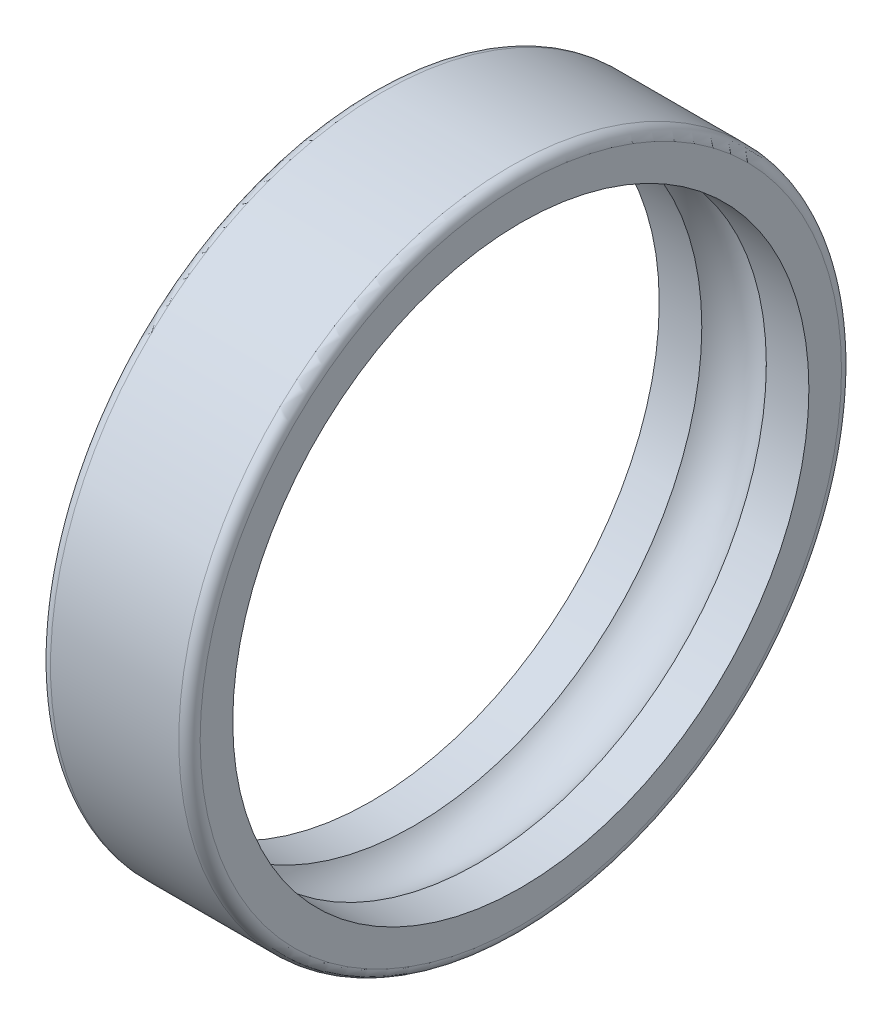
ISO-10303-21;
HEADER;
FILE_DESCRIPTION(('STEP AP214'),'2;1');
FILE_NAME('part.step','',(''),(''),'','','');
FILE_SCHEMA(('AUTOMOTIVE_DESIGN { 1 0 10303 214 1 1 1 1 }'));
ENDSEC;
DATA;
#1=APPLICATION_CONTEXT('core data for automotive mechanical design processes');
#2=APPLICATION_PROTOCOL_DEFINITION('international standard','automotive_design',2000,#1);
#3=PRODUCT_CONTEXT('',#1,'mechanical');
#4=PRODUCT('Part','Part','',(#3));
#5=PRODUCT_RELATED_PRODUCT_CATEGORY('part','',(#4));
#6=PRODUCT_DEFINITION_FORMATION('','',#4);
#7=PRODUCT_DEFINITION_CONTEXT('part definition',#1,'design');
#8=PRODUCT_DEFINITION('design','',#6,#7);
#9=PRODUCT_DEFINITION_SHAPE('','',#8);
#10=(LENGTH_UNIT() NAMED_UNIT(*) SI_UNIT(.MILLI.,.METRE.));
#11=(NAMED_UNIT(*) PLANE_ANGLE_UNIT() SI_UNIT($,.RADIAN.));
#12=(NAMED_UNIT(*) SI_UNIT($,.STERADIAN.) SOLID_ANGLE_UNIT());
#13=UNCERTAINTY_MEASURE_WITH_UNIT(LENGTH_MEASURE(1.E-05),#10,'distance_accuracy_value','');
#14=(GEOMETRIC_REPRESENTATION_CONTEXT(3) GLOBAL_UNCERTAINTY_ASSIGNED_CONTEXT((#13)) GLOBAL_UNIT_ASSIGNED_CONTEXT((#10,
#11,#12)) REPRESENTATION_CONTEXT('',''));
#15=CARTESIAN_POINT('',(0.,0.,0.));
#16=DIRECTION('',(0.,0.,1.));
#17=DIRECTION('',(1.,0.,0.));
#18=AXIS2_PLACEMENT_3D('',#15,#16,#17);
#19=CARTESIAN_POINT('',(1.,0.,0.));
#20=DIRECTION('',(-1.,0.,0.));
#21=DIRECTION('',(0.,-1.,0.));
#22=AXIS2_PLACEMENT_3D('',#19,#20,#21);
#23=TOROIDAL_SURFACE('',#22,30.,1.);
#24=CARTESIAN_POINT('',(0.,0.,0.));
#25=DIRECTION('',(-1.,0.,0.));
#26=DIRECTION('',(0.,-1.,0.));
#27=AXIS2_PLACEMENT_3D('',#24,#25,#26);
#28=CIRCLE('',#27,30.);
#29=CARTESIAN_POINT('',(0.,-30.,0.));
#30=VERTEX_POINT('',#29);
#31=EDGE_CURVE('E10',#30,#30,#28,.T.);
#32=ORIENTED_EDGE('',*,*,#31,.F.);
#33=EDGE_LOOP('',(#32));
#34=FACE_BOUND('',#33,.T.);
#35=CARTESIAN_POINT('',(1.,0.,0.));
#36=DIRECTION('',(-1.,0.,0.));
#37=DIRECTION('',(0.,-1.,0.));
#38=AXIS2_PLACEMENT_3D('',#35,#36,#37);
#39=CIRCLE('',#38,31.);
#40=CARTESIAN_POINT('',(1.,-31.,0.));
#41=VERTEX_POINT('',#40);
#42=EDGE_CURVE('E58',#41,#41,#39,.T.);
#43=ORIENTED_EDGE('',*,*,#42,.T.);
#44=EDGE_LOOP('',(#43));
#45=FACE_BOUND('',#44,.T.);
#46=ADVANCED_FACE('F30',(#34,#45),#23,.T.);
#47=CARTESIAN_POINT('',(0.,26.95,0.));
#48=DIRECTION('',(1.,0.,0.));
#49=DIRECTION('',(0.,1.,0.));
#50=AXIS2_PLACEMENT_3D('',#47,#48,#49);
#51=PLANE('',#50);
#52=CARTESIAN_POINT('',(0.,0.,0.));
#53=DIRECTION('',(-1.,0.,0.));
#54=DIRECTION('',(0.,-1.,0.));
#55=AXIS2_PLACEMENT_3D('',#52,#53,#54);
#56=CIRCLE('',#55,26.95);
#57=CARTESIAN_POINT('',(0.,-26.95,0.));
#58=VERTEX_POINT('',#57);
#59=EDGE_CURVE('E36',#58,#58,#56,.T.);
#60=ORIENTED_EDGE('',*,*,#59,.F.);
#61=EDGE_LOOP('',(#60));
#62=FACE_BOUND('',#61,.T.);
#63=ORIENTED_EDGE('',*,*,#31,.T.);
#64=EDGE_LOOP('',(#63));
#65=FACE_BOUND('',#64,.T.);
#66=ADVANCED_FACE('F95',(#62,#65),#51,.F.);
#67=CARTESIAN_POINT('',(0.,0.,0.));
#68=DIRECTION('',(-1.,0.,0.));
#69=DIRECTION('',(0.,-1.,0.));
#70=AXIS2_PLACEMENT_3D('',#67,#68,#69);
#71=CYLINDRICAL_SURFACE('',#70,26.95);
#72=CARTESIAN_POINT('',(3.98130823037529,0.,0.));
#73=DIRECTION('',(-1.,0.,0.));
#74=DIRECTION('',(0.,-1.,0.));
#75=AXIS2_PLACEMENT_3D('',#72,#73,#74);
#76=CIRCLE('',#75,26.95);
#77=CARTESIAN_POINT('',(3.98130823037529,-26.95,0.));
#78=VERTEX_POINT('',#77);
#79=EDGE_CURVE('E40',#78,#78,#76,.T.);
#80=ORIENTED_EDGE('',*,*,#79,.F.);
#81=EDGE_LOOP('',(#80));
#82=FACE_BOUND('',#81,.T.);
#83=ORIENTED_EDGE('',*,*,#59,.T.);
#84=EDGE_LOOP('',(#83));
#85=FACE_BOUND('',#84,.T.);
#86=ADVANCED_FACE('F90',(#82,#85),#71,.F.);
#87=CARTESIAN_POINT('',(7.00000000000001,0.,0.));
#88=DIRECTION('',(-1.,0.,0.));
#89=DIRECTION('',(0.,-1.,0.));
#90=AXIS2_PLACEMENT_3D('',#87,#88,#89);
#91=TOROIDAL_SURFACE('',#90,24.25,4.05);
#92=CARTESIAN_POINT('',(10.0186917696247,0.,0.));
#93=DIRECTION('',(-1.,0.,0.));
#94=DIRECTION('',(0.,-1.,0.));
#95=AXIS2_PLACEMENT_3D('',#92,#93,#94);
#96=CIRCLE('',#95,26.95);
#97=CARTESIAN_POINT('',(10.0186917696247,-26.95,0.));
#98=VERTEX_POINT('',#97);
#99=EDGE_CURVE('E44',#98,#98,#96,.T.);
#100=ORIENTED_EDGE('',*,*,#99,.F.);
#101=EDGE_LOOP('',(#100));
#102=FACE_BOUND('',#101,.T.);
#103=ORIENTED_EDGE('',*,*,#79,.T.);
#104=EDGE_LOOP('',(#103));
#105=FACE_BOUND('',#104,.T.);
#106=ADVANCED_FACE('F84',(#102,#105),#91,.F.);
#107=CARTESIAN_POINT('',(0.,0.,0.));
#108=DIRECTION('',(-1.,0.,0.));
#109=DIRECTION('',(0.,-1.,0.));
#110=AXIS2_PLACEMENT_3D('',#107,#108,#109);
#111=CYLINDRICAL_SURFACE('',#110,26.95);
#112=CARTESIAN_POINT('',(14.,0.,0.));
#113=DIRECTION('',(-1.,0.,0.));
#114=DIRECTION('',(0.,-1.,0.));
#115=AXIS2_PLACEMENT_3D('',#112,#113,#114);
#116=CIRCLE('',#115,26.95);
#117=CARTESIAN_POINT('',(14.,-26.95,0.));
#118=VERTEX_POINT('',#117);
#119=EDGE_CURVE('E49',#118,#118,#116,.T.);
#120=ORIENTED_EDGE('',*,*,#119,.F.);
#121=EDGE_LOOP('',(#120));
#122=FACE_BOUND('',#121,.T.);
#123=ORIENTED_EDGE('',*,*,#99,.T.);
#124=EDGE_LOOP('',(#123));
#125=FACE_BOUND('',#124,.T.);
#126=ADVANCED_FACE('F78',(#122,#125),#111,.F.);
#127=CARTESIAN_POINT('',(14.,30.,0.));
#128=DIRECTION('',(-1.,0.,0.));
#129=DIRECTION('',(0.,-1.,0.));
#130=AXIS2_PLACEMENT_3D('',#127,#128,#129);
#131=PLANE('',#130);
#132=CARTESIAN_POINT('',(14.,0.,0.));
#133=DIRECTION('',(-1.,0.,0.));
#134=DIRECTION('',(0.,-1.,0.));
#135=AXIS2_PLACEMENT_3D('',#132,#133,#134);
#136=CIRCLE('',#135,30.);
#137=CARTESIAN_POINT('',(14.,-30.,0.));
#138=VERTEX_POINT('',#137);
#139=EDGE_CURVE('E52',#138,#138,#136,.T.);
#140=ORIENTED_EDGE('',*,*,#139,.F.);
#141=EDGE_LOOP('',(#140));
#142=FACE_BOUND('',#141,.T.);
#143=ORIENTED_EDGE('',*,*,#119,.T.);
#144=EDGE_LOOP('',(#143));
#145=FACE_BOUND('',#144,.T.);
#146=ADVANCED_FACE('F72',(#142,#145),#131,.F.);
#147=CARTESIAN_POINT('',(13.,0.,0.));
#148=DIRECTION('',(-1.,0.,0.));
#149=DIRECTION('',(0.,-1.,0.));
#150=AXIS2_PLACEMENT_3D('',#147,#148,#149);
#151=TOROIDAL_SURFACE('',#150,30.,1.);
#152=CARTESIAN_POINT('',(13.,0.,0.));
#153=DIRECTION('',(-1.,0.,0.));
#154=DIRECTION('',(0.,-1.,0.));
#155=AXIS2_PLACEMENT_3D('',#152,#153,#154);
#156=CIRCLE('',#155,31.);
#157=CARTESIAN_POINT('',(13.,-31.,0.));
#158=VERTEX_POINT('',#157);
#159=EDGE_CURVE('E55',#158,#158,#156,.T.);
#160=ORIENTED_EDGE('',*,*,#159,.F.);
#161=EDGE_LOOP('',(#160));
#162=FACE_BOUND('',#161,.T.);
#163=ORIENTED_EDGE('',*,*,#139,.T.);
#164=EDGE_LOOP('',(#163));
#165=FACE_BOUND('',#164,.T.);
#166=ADVANCED_FACE('F66',(#162,#165),#151,.T.);
#167=CARTESIAN_POINT('',(0.,0.,0.));
#168=DIRECTION('',(-1.,0.,0.));
#169=DIRECTION('',(0.,-1.,0.));
#170=AXIS2_PLACEMENT_3D('',#167,#168,#169);
#171=CYLINDRICAL_SURFACE('',#170,31.);
#172=ORIENTED_EDGE('',*,*,#42,.F.);
#173=EDGE_LOOP('',(#172));
#174=FACE_BOUND('',#173,.T.);
#175=ORIENTED_EDGE('',*,*,#159,.T.);
#176=EDGE_LOOP('',(#175));
#177=FACE_BOUND('',#176,.T.);
#178=ADVANCED_FACE('F63',(#174,#177),#171,.T.);
#179=CLOSED_SHELL('',(#46,#66,#86,#106,#126,#146,#166,#178));
#180=MANIFOLD_SOLID_BREP('B2',#179);
#181=ADVANCED_BREP_SHAPE_REPRESENTATION('',(#18,#180),#14);
#182=SHAPE_DEFINITION_REPRESENTATION(#9,#181);
ENDSEC;
END-ISO-10303-21;
